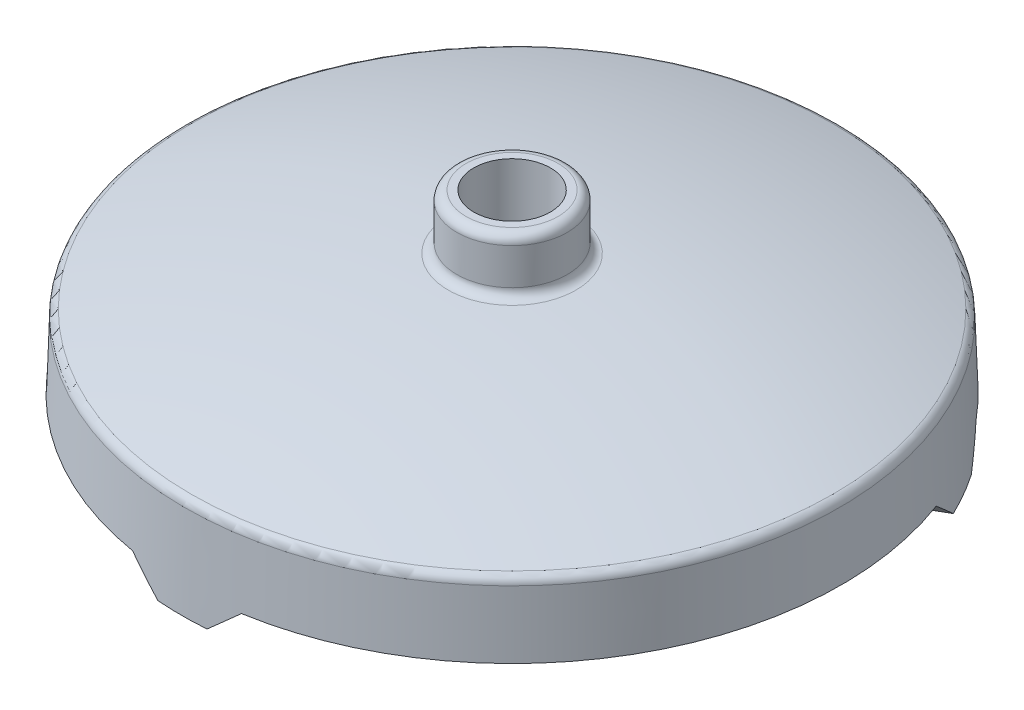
ISO-10303-21;
HEADER;
FILE_DESCRIPTION(('STEP AP214'),'2;1');
FILE_NAME('part.step','',(''),(''),'','','');
FILE_SCHEMA(('AUTOMOTIVE_DESIGN { 1 0 10303 214 1 1 1 1 }'));
ENDSEC;
DATA;
#1=APPLICATION_CONTEXT('core data for automotive mechanical design processes');
#2=APPLICATION_PROTOCOL_DEFINITION('international standard','automotive_design',2000,#1);
#3=PRODUCT_CONTEXT('',#1,'mechanical');
#4=PRODUCT('Part','Part','',(#3));
#5=PRODUCT_RELATED_PRODUCT_CATEGORY('part','',(#4));
#6=PRODUCT_DEFINITION_FORMATION('','',#4);
#7=PRODUCT_DEFINITION_CONTEXT('part definition',#1,'design');
#8=PRODUCT_DEFINITION('design','',#6,#7);
#9=PRODUCT_DEFINITION_SHAPE('','',#8);
#10=(LENGTH_UNIT() NAMED_UNIT(*) SI_UNIT(.MILLI.,.METRE.));
#11=(NAMED_UNIT(*) PLANE_ANGLE_UNIT() SI_UNIT($,.RADIAN.));
#12=(NAMED_UNIT(*) SI_UNIT($,.STERADIAN.) SOLID_ANGLE_UNIT());
#13=UNCERTAINTY_MEASURE_WITH_UNIT(LENGTH_MEASURE(1.E-05),#10,'distance_accuracy_value','');
#14=(GEOMETRIC_REPRESENTATION_CONTEXT(3) GLOBAL_UNCERTAINTY_ASSIGNED_CONTEXT((#13)) GLOBAL_UNIT_ASSIGNED_CONTEXT((#10,
#11,#12)) REPRESENTATION_CONTEXT('',''));
#15=CARTESIAN_POINT('',(0.,0.,0.));
#16=DIRECTION('',(0.,0.,1.));
#17=DIRECTION('',(1.,0.,0.));
#18=AXIS2_PLACEMENT_3D('',#15,#16,#17);
#19=CARTESIAN_POINT('',(0.,0.,0.));
#20=DIRECTION('',(0.,1.,0.));
#21=DIRECTION('',(0.,0.,1.));
#22=AXIS2_PLACEMENT_3D('',#19,#20,#21);
#23=PLANE('',#22);
#24=DIRECTION('',(-0.866025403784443,0.,0.499999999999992));
#25=VECTOR('',#24,1.);
#26=CARTESIAN_POINT('',(231.078272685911,0.,-128.720399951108));
#27=LINE('',#26,#25);
#28=CARTESIAN_POINT('',(49.3047966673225,0.,-23.7734346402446));
#29=VERTEX_POINT('',#28);
#30=CARTESIAN_POINT('',(45.8644162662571,0.,-21.7871300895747));
#31=VERTEX_POINT('',#30);
#32=EDGE_CURVE('E135',#29,#31,#27,.T.);
#33=ORIENTED_EDGE('',*,*,#32,.T.);
#34=CARTESIAN_POINT('',(0.,0.,0.));
#35=DIRECTION('',(0.,-1.,0.));
#36=DIRECTION('',(0.,0.,-1.));
#37=AXIS2_PLACEMENT_3D('',#34,#35,#36);
#38=CIRCLE('',#37,50.7762121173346);
#39=CARTESIAN_POINT('',(41.8004162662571,0.,-28.8261845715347));
#40=VERTEX_POINT('',#39);
#41=EDGE_CURVE('E125',#40,#31,#38,.T.);
#42=ORIENTED_EDGE('',*,*,#41,.F.);
#43=DIRECTION('',(0.866025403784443,0.,-0.499999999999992));
#44=VECTOR('',#43,1.);
#45=CARTESIAN_POINT('',(-2.03199999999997,0.,-3.51952724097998));
#46=LINE('',#45,#44);
#47=CARTESIAN_POINT('',(45.2407966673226,0.,-30.8124891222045));
#48=VERTEX_POINT('',#47);
#49=EDGE_CURVE('E133',#40,#48,#46,.T.);
#50=ORIENTED_EDGE('',*,*,#49,.T.);
#51=CARTESIAN_POINT('',(0.,0.,0.));
#52=DIRECTION('',(0.,1.,0.));
#53=DIRECTION('',(0.866025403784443,0.,-0.499999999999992));
#54=AXIS2_PLACEMENT_3D('',#51,#52,#53);
#55=CIRCLE('',#54,54.737);
#56=EDGE_CURVE('E144',#29,#48,#55,.T.);
#57=ORIENTED_EDGE('',*,*,#56,.F.);
#58=EDGE_LOOP('',(#33,#42,#50,#57));
#59=FACE_BOUND('',#58,.T.);
#60=ADVANCED_FACE('F36',(#59),#23,.F.);
#61=DIRECTION('',(0.866025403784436,0.,0.500000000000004));
#62=VECTOR('',#61,1.);
#63=CARTESIAN_POINT('',(-227.014272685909,0.,-135.759454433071));
#64=LINE('',#63,#62);
#65=CARTESIAN_POINT('',(-45.2407966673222,0.,-30.8124891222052));
#66=VERTEX_POINT('',#65);
#67=CARTESIAN_POINT('',(-41.8004162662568,0.,-28.8261845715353));
#68=VERTEX_POINT('',#67);
#69=EDGE_CURVE('E155',#66,#68,#64,.T.);
#70=ORIENTED_EDGE('',*,*,#69,.T.);
#71=CARTESIAN_POINT('',(-45.8644162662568,0.,-21.7871300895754));
#72=VERTEX_POINT('',#71);
#73=EDGE_CURVE('E139',#72,#68,#38,.T.);
#74=ORIENTED_EDGE('',*,*,#73,.F.);
#75=DIRECTION('',(-0.866025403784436,0.,-0.500000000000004));
#76=VECTOR('',#75,1.);
#77=CARTESIAN_POINT('',(-2.03200000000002,0.,3.51952724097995));
#78=LINE('',#77,#76);
#79=CARTESIAN_POINT('',(-49.3047966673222,0.,-23.7734346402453));
#80=VERTEX_POINT('',#79);
#81=EDGE_CURVE('E159',#72,#80,#78,.T.);
#82=ORIENTED_EDGE('',*,*,#81,.T.);
#83=CARTESIAN_POINT('',(0.,0.,0.));
#84=DIRECTION('',(0.,1.,0.));
#85=DIRECTION('',(-0.866025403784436,0.,-0.500000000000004));
#86=AXIS2_PLACEMENT_3D('',#83,#84,#85);
#87=CIRCLE('',#86,54.737);
#88=EDGE_CURVE('E168',#66,#80,#87,.T.);
#89=ORIENTED_EDGE('',*,*,#88,.F.);
#90=EDGE_LOOP('',(#70,#74,#82,#89));
#91=FACE_BOUND('',#90,.T.);
#92=ADVANCED_FACE('F268',(#91),#23,.F.);
#93=CARTESIAN_POINT('',(4.064,0.,264.47985438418));
#94=DIRECTION('',(-0.657135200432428,0.753772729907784,0.));
#95=DIRECTION('',(-0.753772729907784,-0.657135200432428,0.));
#96=AXIS2_PLACEMENT_3D('',#93,#94,#95);
#97=PLANE('',#96);
#98=DIRECTION('',(0.,0.,1.));
#99=VECTOR('',#98,1.);
#100=CARTESIAN_POINT('',(4.064,0.,0.));
#101=LINE('',#100,#99);
#102=CARTESIAN_POINT('',(4.064,0.,50.6133146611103));
#103=VERTEX_POINT('',#102);
#104=CARTESIAN_POINT('',(4.064,0.,54.58592376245));
#105=VERTEX_POINT('',#104);
#106=EDGE_CURVE('E58',#103,#105,#101,.T.);
#107=ORIENTED_EDGE('',*,*,#106,.F.);
#108=CARTESIAN_POINT('',(0.,-3.54297435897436,0.));
#109=DIRECTION('',(-0.657135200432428,0.753772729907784,0.));
#110=DIRECTION('',(-0.753772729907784,-0.657135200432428,0.));
#111=AXIS2_PLACEMENT_3D('',#108,#109,#110);
#112=ELLIPSE('',#111,67.3627608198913,50.7762121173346);
#113=CARTESIAN_POINT('',(9.017,4.318,49.9691647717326));
#114=VERTEX_POINT('',#113);
#115=EDGE_CURVE('E240',#103,#114,#112,.T.);
#116=ORIENTED_EDGE('',*,*,#115,.T.);
#117=DIRECTION('',(0.,0.,-1.));
#118=VECTOR('',#117,1.);
#119=CARTESIAN_POINT('',(9.017,4.318,264.47985438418));
#120=LINE('',#119,#118);
#121=CARTESIAN_POINT('',(9.017,4.318,53.8363099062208));
#122=VERTEX_POINT('',#121);
#123=EDGE_CURVE('E158',#122,#114,#120,.T.);
#124=ORIENTED_EDGE('',*,*,#123,.F.);
#125=CARTESIAN_POINT('',(-1.67171540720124,-5.00036727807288,0.));
#126=DIRECTION('',(-0.657135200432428,0.753772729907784,0.));
#127=DIRECTION('',(-0.753772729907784,-0.657135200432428,0.));
#128=AXIS2_PLACEMENT_3D('',#125,#126,#127);
#129=ELLIPSE('',#128,72.8490359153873,54.8861641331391);
#130=EDGE_CURVE('E181',#105,#122,#129,.T.);
#131=ORIENTED_EDGE('',*,*,#130,.F.);
#132=EDGE_LOOP('',(#107,#116,#124,#131));
#133=FACE_BOUND('',#132,.T.);
#134=ADVANCED_FACE('F255',(#133),#97,.F.);
#135=CARTESIAN_POINT('',(-9.017,4.318,264.47985438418));
#136=DIRECTION('',(0.,1.,0.));
#137=DIRECTION('',(-1.,0.,0.));
#138=AXIS2_PLACEMENT_3D('',#135,#136,#137);
#139=PLANE('',#138);
#140=DIRECTION('',(0.866025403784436,0.,0.500000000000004));
#141=VECTOR('',#140,1.);
#142=CARTESIAN_POINT('',(-233.554772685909,4.318,-124.430976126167));
#143=LINE('',#142,#141);
#144=CARTESIAN_POINT('',(-51.132112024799,4.318,-19.1092038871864));
#145=VERTEX_POINT('',#144);
#146=CARTESIAN_POINT('',(-47.7830660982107,4.318,-17.1756313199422));
#147=VERTEX_POINT('',#146);
#148=EDGE_CURVE('E146',#145,#147,#143,.T.);
#149=ORIENTED_EDGE('',*,*,#148,.T.);
#150=CARTESIAN_POINT('',(0.,4.318,0.));
#151=DIRECTION('',(0.,1.,0.));
#152=DIRECTION('',(-1.,0.,0.));
#153=AXIS2_PLACEMENT_3D('',#150,#151,#152);
#154=CIRCLE('',#153,50.7762121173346);
#155=CARTESIAN_POINT('',(-9.017,4.318,49.9691647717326));
#156=VERTEX_POINT('',#155);
#157=EDGE_CURVE('E225',#147,#156,#154,.T.);
#158=ORIENTED_EDGE('',*,*,#157,.T.);
#159=DIRECTION('',(0.,0.,-1.));
#160=VECTOR('',#159,1.);
#161=CARTESIAN_POINT('',(-9.017,4.318,264.47985438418));
#162=LINE('',#161,#160);
#163=CARTESIAN_POINT('',(-9.017,4.318,53.8363099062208));
#164=VERTEX_POINT('',#163);
#165=EDGE_CURVE('E174',#164,#156,#162,.T.);
#166=ORIENTED_EDGE('',*,*,#165,.F.);
#167=CARTESIAN_POINT('',(0.,4.318,0.));
#168=DIRECTION('',(0.,1.,0.));
#169=DIRECTION('',(-1.,0.,0.));
#170=AXIS2_PLACEMENT_3D('',#167,#168,#169);
#171=CIRCLE('',#170,54.5862121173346);
#172=EDGE_CURVE('E178',#145,#164,#171,.T.);
#173=ORIENTED_EDGE('',*,*,#172,.F.);
#174=EDGE_LOOP('',(#149,#158,#166,#173));
#175=FACE_BOUND('',#174,.T.);
#176=ADVANCED_FACE('F224',(#175),#139,.F.);
#177=DIRECTION('',(-0.866025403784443,0.,0.499999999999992));
#178=VECTOR('',#177,1.);
#179=CARTESIAN_POINT('',(224.537772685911,4.318,-140.048878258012));
#180=LINE('',#179,#178);
#181=CARTESIAN_POINT('',(42.1151120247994,4.31799999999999,-34.7271060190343));
#182=VERTEX_POINT('',#181);
#183=CARTESIAN_POINT('',(38.7660660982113,4.318,-32.7935334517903));
#184=VERTEX_POINT('',#183);
#185=EDGE_CURVE('E243',#182,#184,#180,.T.);
#186=ORIENTED_EDGE('',*,*,#185,.T.);
#187=CARTESIAN_POINT('',(0.,4.318,0.));
#188=DIRECTION('',(0.,1.,0.));
#189=DIRECTION('',(-1.,0.,0.));
#190=AXIS2_PLACEMENT_3D('',#187,#188,#189);
#191=CIRCLE('',#190,50.7762121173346);
#192=CARTESIAN_POINT('',(-38.7660660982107,4.318,-32.7935334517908));
#193=VERTEX_POINT('',#192);
#194=EDGE_CURVE('E51',#184,#193,#191,.T.);
#195=ORIENTED_EDGE('',*,*,#194,.T.);
#196=DIRECTION('',(0.866025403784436,0.,0.500000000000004));
#197=VECTOR('',#196,1.);
#198=CARTESIAN_POINT('',(-224.537772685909,4.318,-140.048878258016));
#199=LINE('',#198,#197);
#200=CARTESIAN_POINT('',(-42.1151120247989,4.318,-34.7271060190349));
#201=VERTEX_POINT('',#200);
#202=EDGE_CURVE('E154',#201,#193,#199,.T.);
#203=ORIENTED_EDGE('',*,*,#202,.F.);
#204=EDGE_CURVE('E209',#182,#201,#171,.T.);
#205=ORIENTED_EDGE('',*,*,#204,.F.);
#206=EDGE_LOOP('',(#186,#195,#203,#205));
#207=FACE_BOUND('',#206,.T.);
#208=ADVANCED_FACE('F272',(#207),#139,.F.);
#209=ORIENTED_EDGE('',*,*,#123,.T.);
#210=CARTESIAN_POINT('',(0.,4.318,0.));
#211=DIRECTION('',(0.,1.,0.));
#212=DIRECTION('',(-1.,0.,0.));
#213=AXIS2_PLACEMENT_3D('',#210,#211,#212);
#214=CIRCLE('',#213,50.7762121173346);
#215=CARTESIAN_POINT('',(47.7830660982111,4.318,-17.1756313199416));
#216=VERTEX_POINT('',#215);
#217=EDGE_CURVE('E237',#114,#216,#214,.T.);
#218=ORIENTED_EDGE('',*,*,#217,.T.);
#219=DIRECTION('',(-0.866025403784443,0.,0.499999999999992));
#220=VECTOR('',#219,1.);
#221=CARTESIAN_POINT('',(233.554772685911,4.318,-124.430976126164));
#222=LINE('',#221,#220);
#223=CARTESIAN_POINT('',(51.1321120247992,4.31799999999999,-19.1092038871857));
#224=VERTEX_POINT('',#223);
#225=EDGE_CURVE('E244',#224,#216,#222,.T.);
#226=ORIENTED_EDGE('',*,*,#225,.F.);
#227=EDGE_CURVE('E44',#122,#224,#171,.T.);
#228=ORIENTED_EDGE('',*,*,#227,.F.);
#229=EDGE_LOOP('',(#209,#218,#226,#228));
#230=FACE_BOUND('',#229,.T.);
#231=ADVANCED_FACE('F252',(#230),#139,.F.);
#232=CARTESIAN_POINT('',(-4.064,0.,264.47985438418));
#233=DIRECTION('',(0.657135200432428,0.753772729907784,0.));
#234=DIRECTION('',(-0.753772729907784,0.657135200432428,0.));
#235=AXIS2_PLACEMENT_3D('',#232,#233,#234);
#236=PLANE('',#235);
#237=ORIENTED_EDGE('',*,*,#165,.T.);
#238=CARTESIAN_POINT('',(0.,-3.54297435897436,0.));
#239=DIRECTION('',(0.657135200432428,0.753772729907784,0.));
#240=DIRECTION('',(0.753772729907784,-0.657135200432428,0.));
#241=AXIS2_PLACEMENT_3D('',#238,#239,#240);
#242=ELLIPSE('',#241,67.3627608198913,50.7762121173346);
#243=CARTESIAN_POINT('',(-4.064,0.,50.6133146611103));
#244=VERTEX_POINT('',#243);
#245=EDGE_CURVE('E227',#156,#244,#242,.T.);
#246=ORIENTED_EDGE('',*,*,#245,.T.);
#247=DIRECTION('',(0.,0.,-1.));
#248=VECTOR('',#247,1.);
#249=CARTESIAN_POINT('',(-4.064,0.,264.47985438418));
#250=LINE('',#249,#248);
#251=CARTESIAN_POINT('',(-4.064,0.,54.58592376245));
#252=VERTEX_POINT('',#251);
#253=EDGE_CURVE('E175',#252,#244,#250,.T.);
#254=ORIENTED_EDGE('',*,*,#253,.F.);
#255=CARTESIAN_POINT('',(1.67171540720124,-5.00036727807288,0.));
#256=DIRECTION('',(0.657135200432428,0.753772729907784,0.));
#257=DIRECTION('',(0.753772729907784,-0.657135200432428,0.));
#258=AXIS2_PLACEMENT_3D('',#255,#256,#257);
#259=ELLIPSE('',#258,72.8490359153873,54.8861641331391);
#260=EDGE_CURVE('E184',#164,#252,#259,.T.);
#261=ORIENTED_EDGE('',*,*,#260,.F.);
#262=EDGE_LOOP('',(#237,#246,#254,#261));
#263=FACE_BOUND('',#262,.T.);
#264=ADVANCED_FACE('F221',(#263),#236,.F.);
#265=CARTESIAN_POINT('',(0.,-149.314611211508,0.));
#266=DIRECTION('',(0.,0.,1.));
#267=DIRECTION('',(1.,0.,0.));
#268=AXIS2_PLACEMENT_3D('',#265,#266,#267);
#269=SPHERICAL_SURFACE('',#268,174.206611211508);
#270=CARTESIAN_POINT('',(0.,-149.314611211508,0.));
#271=DIRECTION('',(0.,-1.,0.));
#272=DIRECTION('',(0.,0.,-1.));
#273=AXIS2_PLACEMENT_3D('',#270,#271,#272);
#274=SPHERICAL_SURFACE('',#273,174.206611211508);
#275=CARTESIAN_POINT('',(0.,16.5865065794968,0.));
#276=DIRECTION('',(0.,-1.,0.));
#277=DIRECTION('',(0.,0.,-1.));
#278=AXIS2_PLACEMENT_3D('',#275,#276,#277);
#279=CIRCLE('',#278,53.1484948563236);
#280=CARTESIAN_POINT('',(0.,16.5865065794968,-53.1484948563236));
#281=VERTEX_POINT('',#280);
#282=EDGE_CURVE('E202',#281,#281,#279,.F.);
#283=ORIENTED_EDGE('',*,*,#282,.T.);
#284=EDGE_LOOP('',(#283));
#285=FACE_BOUND('',#284,.T.);
#286=CARTESIAN_POINT('',(0.,24.5707031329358,0.));
#287=DIRECTION('',(0.,-1.,0.));
#288=DIRECTION('',(0.,0.,-1.));
#289=AXIS2_PLACEMENT_3D('',#286,#287,#288);
#290=CIRCLE('',#289,10.5754832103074);
#291=CARTESIAN_POINT('',(0.,24.5707031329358,-10.5754832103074));
#292=VERTEX_POINT('',#291);
#293=EDGE_CURVE('E199',#292,#292,#290,.T.);
#294=ORIENTED_EDGE('',*,*,#293,.T.);
#295=EDGE_LOOP('',(#294));
#296=FACE_BOUND('',#295,.T.);
#297=ADVANCED_FACE('F296',(#285,#296),#274,.T.);
#298=CARTESIAN_POINT('',(0.,0.,0.));
#299=DIRECTION('',(0.,-1.,0.));
#300=DIRECTION('',(0.,0.,1.));
#301=AXIS2_PLACEMENT_3D('',#298,#299,#300);
#302=CONICAL_SURFACE('',#301,54.737,0.0349065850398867);
#303=ORIENTED_EDGE('',*,*,#172,.T.);
#304=ORIENTED_EDGE('',*,*,#260,.T.);
#305=CARTESIAN_POINT('',(0.,0.,0.));
#306=DIRECTION('',(0.,1.,0.));
#307=DIRECTION('',(0.,0.,1.));
#308=AXIS2_PLACEMENT_3D('',#305,#306,#307);
#309=CIRCLE('',#308,54.737);
#310=EDGE_CURVE('E187',#252,#105,#309,.T.);
#311=ORIENTED_EDGE('',*,*,#310,.T.);
#312=ORIENTED_EDGE('',*,*,#130,.T.);
#313=ORIENTED_EDGE('',*,*,#227,.T.);
#314=CARTESIAN_POINT('',(-0.835857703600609,-5.00036727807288,-1.44774801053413));
#315=DIRECTION('',(-0.328567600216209,0.753772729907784,-0.569095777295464));
#316=DIRECTION('',(-0.376886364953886,-0.657135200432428,-0.652786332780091));
#317=AXIS2_PLACEMENT_3D('',#314,#315,#316);
#318=ELLIPSE('',#317,72.8490359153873,54.8861641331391);
#319=EDGE_CURVE('E148',#224,#29,#318,.T.);
#320=ORIENTED_EDGE('',*,*,#319,.T.);
#321=ORIENTED_EDGE('',*,*,#56,.T.);
#322=CARTESIAN_POINT('',(0.835857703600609,-5.00036727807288,1.44774801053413));
#323=DIRECTION('',(0.328567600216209,0.753772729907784,0.569095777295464));
#324=DIRECTION('',(0.376886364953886,-0.657135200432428,0.652786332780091));
#325=AXIS2_PLACEMENT_3D('',#322,#323,#324);
#326=ELLIPSE('',#325,72.8490359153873,54.8861641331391);
#327=EDGE_CURVE('E142',#48,#182,#326,.T.);
#328=ORIENTED_EDGE('',*,*,#327,.T.);
#329=ORIENTED_EDGE('',*,*,#204,.T.);
#330=CARTESIAN_POINT('',(-0.835857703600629,-5.00036727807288,1.44774801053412));
#331=DIRECTION('',(-0.328567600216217,0.753772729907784,0.56909577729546));
#332=DIRECTION('',(-0.376886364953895,-0.657135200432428,0.652786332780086));
#333=AXIS2_PLACEMENT_3D('',#330,#331,#332);
#334=ELLIPSE('',#333,72.8490359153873,54.8861641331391);
#335=EDGE_CURVE('E165',#201,#66,#334,.T.);
#336=ORIENTED_EDGE('',*,*,#335,.T.);
#337=ORIENTED_EDGE('',*,*,#88,.T.);
#338=CARTESIAN_POINT('',(0.835857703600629,-5.00036727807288,-1.44774801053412));
#339=DIRECTION('',(0.328567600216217,0.753772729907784,-0.56909577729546));
#340=DIRECTION('',(0.376886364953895,-0.657135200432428,-0.652786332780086));
#341=AXIS2_PLACEMENT_3D('',#338,#339,#340);
#342=ELLIPSE('',#341,72.8490359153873,54.8861641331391);
#343=EDGE_CURVE('E162',#80,#145,#342,.T.);
#344=ORIENTED_EDGE('',*,*,#343,.T.);
#345=EDGE_LOOP('',(#303,#304,#311,#312,#313,#320,#321,#328,#329,#336,#337,#344));
#346=FACE_BOUND('',#345,.T.);
#347=CARTESIAN_POINT('',(0.,15.1883518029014,0.));
#348=DIRECTION('',(0.,-1.,0.));
#349=DIRECTION('',(0.,0.,-1.));
#350=AXIS2_PLACEMENT_3D('',#347,#348,#349);
#351=CIRCLE('',#350,54.2066110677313);
#352=CARTESIAN_POINT('',(0.,15.1883518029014,-54.2066110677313));
#353=VERTEX_POINT('',#352);
#354=EDGE_CURVE('E205',#353,#353,#351,.T.);
#355=ORIENTED_EDGE('',*,*,#354,.T.);
#356=EDGE_LOOP('',(#355));
#357=FACE_BOUND('',#356,.T.);
#358=ADVANCED_FACE('F215',(#346,#357),#302,.T.);
#359=ORIENTED_EDGE('',*,*,#253,.T.);
#360=EDGE_CURVE('E137',#103,#244,#38,.T.);
#361=ORIENTED_EDGE('',*,*,#360,.F.);
#362=ORIENTED_EDGE('',*,*,#106,.T.);
#363=ORIENTED_EDGE('',*,*,#310,.F.);
#364=EDGE_LOOP('',(#359,#361,#362,#363));
#365=FACE_BOUND('',#364,.T.);
#366=ADVANCED_FACE('F256',(#365),#23,.F.);
#367=CARTESIAN_POINT('',(0.,33.655,0.));
#368=DIRECTION('',(0.,-1.,0.));
#369=DIRECTION('',(0.,0.,-1.));
#370=AXIS2_PLACEMENT_3D('',#367,#368,#369);
#371=CYLINDRICAL_SURFACE('',#370,9.144);
#372=CARTESIAN_POINT('',(0.,32.131,0.));
#373=DIRECTION('',(0.,1.,0.));
#374=DIRECTION('',(0.,0.,1.));
#375=AXIS2_PLACEMENT_3D('',#372,#373,#374);
#376=CIRCLE('',#375,9.144);
#377=CARTESIAN_POINT('',(0.,32.131,9.144));
#378=VERTEX_POINT('',#377);
#379=EDGE_CURVE('E196',#378,#378,#376,.F.);
#380=ORIENTED_EDGE('',*,*,#379,.T.);
#381=EDGE_LOOP('',(#380));
#382=FACE_BOUND('',#381,.T.);
#383=CARTESIAN_POINT('',(0.,26.0918923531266,0.));
#384=DIRECTION('',(0.,-1.,0.));
#385=DIRECTION('',(0.,0.,-1.));
#386=AXIS2_PLACEMENT_3D('',#383,#384,#385);
#387=CIRCLE('',#386,9.144);
#388=CARTESIAN_POINT('',(0.,26.0918923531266,-9.144));
#389=VERTEX_POINT('',#388);
#390=EDGE_CURVE('E193',#389,#389,#387,.F.);
#391=ORIENTED_EDGE('',*,*,#390,.T.);
#392=EDGE_LOOP('',(#391));
#393=FACE_BOUND('',#392,.T.);
#394=ADVANCED_FACE('F289',(#382,#393),#371,.T.);
#395=CARTESIAN_POINT('',(0.,33.655,0.));
#396=DIRECTION('',(0.,1.,0.));
#397=DIRECTION('',(0.,0.,1.));
#398=AXIS2_PLACEMENT_3D('',#395,#396,#397);
#399=PLANE('',#398);
#400=CARTESIAN_POINT('',(0.,33.655,0.));
#401=DIRECTION('',(0.,1.,0.));
#402=DIRECTION('',(0.,0.,1.));
#403=AXIS2_PLACEMENT_3D('',#400,#401,#402);
#404=CIRCLE('',#403,6.35);
#405=CARTESIAN_POINT('',(0.,33.655,6.35));
#406=VERTEX_POINT('',#405);
#407=EDGE_CURVE('E525',#406,#406,#404,.T.);
#408=ORIENTED_EDGE('',*,*,#407,.F.);
#409=EDGE_LOOP('',(#408));
#410=FACE_BOUND('',#409,.T.);
#411=CARTESIAN_POINT('',(0.,33.655,0.));
#412=DIRECTION('',(0.,1.,0.));
#413=DIRECTION('',(0.,0.,1.));
#414=AXIS2_PLACEMENT_3D('',#411,#412,#413);
#415=CIRCLE('',#414,7.62);
#416=CARTESIAN_POINT('',(0.,33.655,7.62));
#417=VERTEX_POINT('',#416);
#418=EDGE_CURVE('E190',#417,#417,#415,.T.);
#419=ORIENTED_EDGE('',*,*,#418,.T.);
#420=EDGE_LOOP('',(#419));
#421=FACE_BOUND('',#420,.T.);
#422=ADVANCED_FACE('F294',(#410,#421),#399,.T.);
#423=CARTESIAN_POINT('',(0.,32.131,0.));
#424=DIRECTION('',(0.,1.,0.));
#425=DIRECTION('',(0.,0.,1.));
#426=AXIS2_PLACEMENT_3D('',#423,#424,#425);
#427=TOROIDAL_SURFACE('',#426,7.62,1.524);
#428=ORIENTED_EDGE('',*,*,#379,.F.);
#429=EDGE_LOOP('',(#428));
#430=FACE_BOUND('',#429,.T.);
#431=ORIENTED_EDGE('',*,*,#418,.F.);
#432=EDGE_LOOP('',(#431));
#433=FACE_BOUND('',#432,.T.);
#434=ADVANCED_FACE('F303',(#430,#433),#427,.T.);
#435=CARTESIAN_POINT('',(0.,15.1351649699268,0.));
#436=DIRECTION('',(0.,-1.,0.));
#437=DIRECTION('',(0.,0.,-1.));
#438=AXIS2_PLACEMENT_3D('',#435,#436,#437);
#439=TOROIDAL_SURFACE('',#438,52.6835394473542,1.524);
#440=ORIENTED_EDGE('',*,*,#354,.F.);
#441=EDGE_LOOP('',(#440));
#442=FACE_BOUND('',#441,.T.);
#443=ORIENTED_EDGE('',*,*,#282,.F.);
#444=EDGE_LOOP('',(#443));
#445=FACE_BOUND('',#444,.T.);
#446=ADVANCED_FACE('F305',(#442,#445),#439,.T.);
#447=CARTESIAN_POINT('',(0.,26.0918923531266,0.));
#448=DIRECTION('',(0.,-1.,0.));
#449=DIRECTION('',(0.,0.,-1.));
#450=AXIS2_PLACEMENT_3D('',#447,#448,#449);
#451=TOROIDAL_SURFACE('',#450,10.668,1.524);
#452=ORIENTED_EDGE('',*,*,#390,.F.);
#453=EDGE_LOOP('',(#452));
#454=FACE_BOUND('',#453,.T.);
#455=ORIENTED_EDGE('',*,*,#293,.F.);
#456=EDGE_LOOP('',(#455));
#457=FACE_BOUND('',#456,.T.);
#458=ADVANCED_FACE('F38',(#454,#457),#451,.F.);
#459=CARTESIAN_POINT('',(231.078272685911,0.,-128.720399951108));
#460=DIRECTION('',(-0.328567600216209,0.753772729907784,-0.569095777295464));
#461=DIRECTION('',(0.376886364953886,0.657135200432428,0.652786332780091));
#462=AXIS2_PLACEMENT_3D('',#459,#460,#461);
#463=PLANE('',#462);
#464=ORIENTED_EDGE('',*,*,#225,.T.);
#465=CARTESIAN_POINT('',(0.,-3.54297435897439,0.));
#466=DIRECTION('',(-0.328567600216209,0.753772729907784,-0.569095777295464));
#467=DIRECTION('',(-0.376886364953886,-0.657135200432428,-0.652786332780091));
#468=AXIS2_PLACEMENT_3D('',#465,#466,#467);
#469=ELLIPSE('',#468,67.3627608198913,50.7762121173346);
#470=EDGE_CURVE('E230',#216,#31,#469,.T.);
#471=ORIENTED_EDGE('',*,*,#470,.T.);
#472=ORIENTED_EDGE('',*,*,#32,.F.);
#473=ORIENTED_EDGE('',*,*,#319,.F.);
#474=EDGE_LOOP('',(#464,#471,#472,#473));
#475=FACE_BOUND('',#474,.T.);
#476=ADVANCED_FACE('F250',(#475),#463,.F.);
#477=CARTESIAN_POINT('',(-231.078272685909,0.,-128.720399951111));
#478=DIRECTION('',(0.328567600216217,0.753772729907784,-0.56909577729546));
#479=DIRECTION('',(0.376886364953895,-0.657135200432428,-0.652786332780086));
#480=AXIS2_PLACEMENT_3D('',#477,#478,#479);
#481=PLANE('',#480);
#482=ORIENTED_EDGE('',*,*,#81,.F.);
#483=CARTESIAN_POINT('',(0.,-3.54297435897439,0.));
#484=DIRECTION('',(0.328567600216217,0.753772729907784,-0.56909577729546));
#485=DIRECTION('',(0.376886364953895,-0.657135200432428,-0.652786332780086));
#486=AXIS2_PLACEMENT_3D('',#483,#484,#485);
#487=ELLIPSE('',#486,67.3627608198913,50.7762121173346);
#488=EDGE_CURVE('E228',#72,#147,#487,.T.);
#489=ORIENTED_EDGE('',*,*,#488,.T.);
#490=ORIENTED_EDGE('',*,*,#148,.F.);
#491=ORIENTED_EDGE('',*,*,#343,.F.);
#492=EDGE_LOOP('',(#482,#489,#490,#491));
#493=FACE_BOUND('',#492,.T.);
#494=ADVANCED_FACE('F322',(#493),#481,.F.);
#495=CARTESIAN_POINT('',(-227.014272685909,0.,-135.759454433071));
#496=DIRECTION('',(-0.328567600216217,0.753772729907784,0.56909577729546));
#497=DIRECTION('',(0.376886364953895,0.657135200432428,-0.652786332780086));
#498=AXIS2_PLACEMENT_3D('',#495,#496,#497);
#499=PLANE('',#498);
#500=ORIENTED_EDGE('',*,*,#202,.T.);
#501=CARTESIAN_POINT('',(0.,-3.54297435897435,0.));
#502=DIRECTION('',(-0.328567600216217,0.753772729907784,0.56909577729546));
#503=DIRECTION('',(-0.376886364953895,-0.657135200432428,0.652786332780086));
#504=AXIS2_PLACEMENT_3D('',#501,#502,#503);
#505=ELLIPSE('',#504,67.3627608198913,50.7762121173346);
#506=EDGE_CURVE('E232',#193,#68,#505,.T.);
#507=ORIENTED_EDGE('',*,*,#506,.T.);
#508=ORIENTED_EDGE('',*,*,#69,.F.);
#509=ORIENTED_EDGE('',*,*,#335,.F.);
#510=EDGE_LOOP('',(#500,#507,#508,#509));
#511=FACE_BOUND('',#510,.T.);
#512=ADVANCED_FACE('F263',(#511),#499,.F.);
#513=CARTESIAN_POINT('',(227.014272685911,0.,-135.759454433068));
#514=DIRECTION('',(0.328567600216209,0.753772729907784,0.569095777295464));
#515=DIRECTION('',(0.376886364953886,-0.657135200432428,0.652786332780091));
#516=AXIS2_PLACEMENT_3D('',#513,#514,#515);
#517=PLANE('',#516);
#518=ORIENTED_EDGE('',*,*,#49,.F.);
#519=CARTESIAN_POINT('',(0.,-3.54297435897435,0.));
#520=DIRECTION('',(0.328567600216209,0.753772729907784,0.569095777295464));
#521=DIRECTION('',(0.376886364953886,-0.657135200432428,0.652786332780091));
#522=AXIS2_PLACEMENT_3D('',#519,#520,#521);
#523=ELLIPSE('',#522,67.3627608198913,50.7762121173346);
#524=EDGE_CURVE('E11',#40,#184,#523,.T.);
#525=ORIENTED_EDGE('',*,*,#524,.T.);
#526=ORIENTED_EDGE('',*,*,#185,.F.);
#527=ORIENTED_EDGE('',*,*,#327,.F.);
#528=EDGE_LOOP('',(#518,#525,#526,#527));
#529=FACE_BOUND('',#528,.T.);
#530=ADVANCED_FACE('F140',(#529),#517,.F.);
#531=CARTESIAN_POINT('',(0.,5.08,0.));
#532=DIRECTION('',(0.,-1.,0.));
#533=DIRECTION('',(0.,0.,-1.));
#534=AXIS2_PLACEMENT_3D('',#531,#532,#533);
#535=CYLINDRICAL_SURFACE('',#534,50.7762121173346);
#536=CARTESIAN_POINT('',(0.,5.08,0.));
#537=DIRECTION('',(0.,-1.,0.));
#538=DIRECTION('',(0.,0.,-1.));
#539=AXIS2_PLACEMENT_3D('',#536,#537,#538);
#540=CIRCLE('',#539,50.7762121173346);
#541=CARTESIAN_POINT('',(0.,5.08,-50.7762121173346));
#542=VERTEX_POINT('',#541);
#543=EDGE_CURVE('E136',#542,#542,#540,.T.);
#544=ORIENTED_EDGE('',*,*,#543,.F.);
#545=EDGE_LOOP('',(#544));
#546=FACE_BOUND('',#545,.T.);
#547=ORIENTED_EDGE('',*,*,#360,.T.);
#548=ORIENTED_EDGE('',*,*,#245,.F.);
#549=ORIENTED_EDGE('',*,*,#157,.F.);
#550=ORIENTED_EDGE('',*,*,#488,.F.);
#551=ORIENTED_EDGE('',*,*,#73,.T.);
#552=ORIENTED_EDGE('',*,*,#506,.F.);
#553=ORIENTED_EDGE('',*,*,#194,.F.);
#554=ORIENTED_EDGE('',*,*,#524,.F.);
#555=ORIENTED_EDGE('',*,*,#41,.T.);
#556=ORIENTED_EDGE('',*,*,#470,.F.);
#557=ORIENTED_EDGE('',*,*,#217,.F.);
#558=ORIENTED_EDGE('',*,*,#115,.F.);
#559=EDGE_LOOP('',(#547,#548,#549,#550,#551,#552,#553,#554,#555,#556,#557,#558));
#560=FACE_BOUND('',#559,.T.);
#561=ADVANCED_FACE('F124',(#546,#560),#535,.F.);
#562=CARTESIAN_POINT('',(0.,5.08,0.));
#563=DIRECTION('',(0.,-1.,0.));
#564=DIRECTION('',(0.,0.,-1.));
#565=AXIS2_PLACEMENT_3D('',#562,#563,#564);
#566=PLANE('',#565);
#567=ORIENTED_EDGE('',*,*,#543,.T.);
#568=EDGE_LOOP('',(#567));
#569=FACE_BOUND('',#568,.T.);
#570=ADVANCED_FACE('F492',(#569),#566,.T.);
#571=CARTESIAN_POINT('',(0.,8.255,0.));
#572=DIRECTION('',(0.,1.,0.));
#573=DIRECTION('',(0.,0.,1.));
#574=AXIS2_PLACEMENT_3D('',#571,#572,#573);
#575=CYLINDRICAL_SURFACE('',#574,6.35);
#576=CARTESIAN_POINT('',(0.,8.255,0.));
#577=DIRECTION('',(0.,1.,0.));
#578=DIRECTION('',(0.,0.,1.));
#579=AXIS2_PLACEMENT_3D('',#576,#577,#578);
#580=CIRCLE('',#579,6.35);
#581=CARTESIAN_POINT('',(0.,8.255,6.35));
#582=VERTEX_POINT('',#581);
#583=EDGE_CURVE('E257',#582,#582,#580,.T.);
#584=ORIENTED_EDGE('',*,*,#583,.F.);
#585=EDGE_LOOP('',(#584));
#586=FACE_BOUND('',#585,.T.);
#587=ORIENTED_EDGE('',*,*,#407,.T.);
#588=EDGE_LOOP('',(#587));
#589=FACE_BOUND('',#588,.T.);
#590=ADVANCED_FACE('F497',(#586,#589),#575,.F.);
#591=CARTESIAN_POINT('',(0.,8.255,0.));
#592=DIRECTION('',(0.,1.,0.));
#593=DIRECTION('',(0.,0.,1.));
#594=AXIS2_PLACEMENT_3D('',#591,#592,#593);
#595=PLANE('',#594);
#596=ORIENTED_EDGE('',*,*,#583,.T.);
#597=EDGE_LOOP('',(#596));
#598=FACE_BOUND('',#597,.T.);
#599=ADVANCED_FACE('F504',(#598),#595,.T.);
#600=CLOSED_SHELL('',(#60,#92,#134,#176,#208,#231,#264,#297,#358,#366,#394,#422,#434,#446,#458,
#476,#494,#512,#530,#561,#570,#590,#599));
#601=MANIFOLD_SOLID_BREP('B2',#600);
#602=ADVANCED_BREP_SHAPE_REPRESENTATION('',(#18,#601),#14);
#603=SHAPE_DEFINITION_REPRESENTATION(#9,#602);
ENDSEC;
END-ISO-10303-21;
